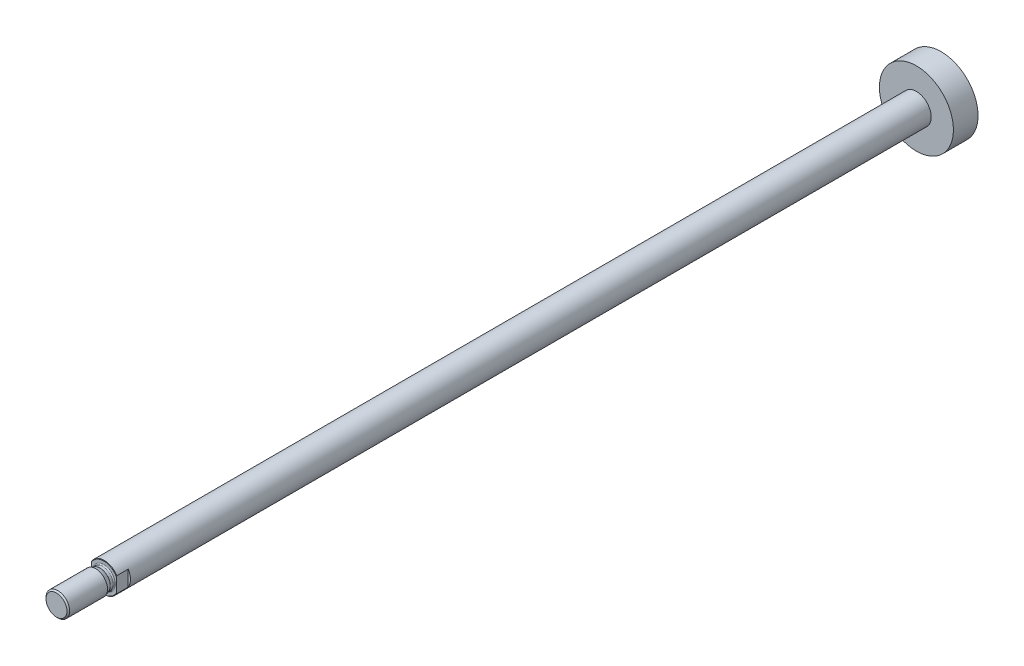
ISO-10303-21;
HEADER;
FILE_DESCRIPTION(('STEP AP214'),'2;1');
FILE_NAME('part.step','',(''),(''),'','','');
FILE_SCHEMA(('AUTOMOTIVE_DESIGN { 1 0 10303 214 1 1 1 1 }'));
ENDSEC;
DATA;
#1=APPLICATION_CONTEXT('core data for automotive mechanical design processes');
#2=APPLICATION_PROTOCOL_DEFINITION('international standard','automotive_design',2000,#1);
#3=PRODUCT_CONTEXT('',#1,'mechanical');
#4=PRODUCT('Part','Part','',(#3));
#5=PRODUCT_RELATED_PRODUCT_CATEGORY('part','',(#4));
#6=PRODUCT_DEFINITION_FORMATION('','',#4);
#7=PRODUCT_DEFINITION_CONTEXT('part definition',#1,'design');
#8=PRODUCT_DEFINITION('design','',#6,#7);
#9=PRODUCT_DEFINITION_SHAPE('','',#8);
#10=(LENGTH_UNIT() NAMED_UNIT(*) SI_UNIT(.MILLI.,.METRE.));
#11=(NAMED_UNIT(*) PLANE_ANGLE_UNIT() SI_UNIT($,.RADIAN.));
#12=(NAMED_UNIT(*) SI_UNIT($,.STERADIAN.) SOLID_ANGLE_UNIT());
#13=UNCERTAINTY_MEASURE_WITH_UNIT(LENGTH_MEASURE(1.E-05),#10,'distance_accuracy_value','');
#14=(GEOMETRIC_REPRESENTATION_CONTEXT(3) GLOBAL_UNCERTAINTY_ASSIGNED_CONTEXT((#13)) GLOBAL_UNIT_ASSIGNED_CONTEXT((#10,
#11,#12)) REPRESENTATION_CONTEXT('',''));
#15=CARTESIAN_POINT('',(0.,0.,0.));
#16=DIRECTION('',(0.,0.,1.));
#17=DIRECTION('',(1.,0.,0.));
#18=AXIS2_PLACEMENT_3D('',#15,#16,#17);
#19=CARTESIAN_POINT('',(-25.,0.,-356.333333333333));
#20=DIRECTION('',(0.,0.,1.));
#21=DIRECTION('',(1.,0.,0.));
#22=AXIS2_PLACEMENT_3D('',#19,#20,#21);
#23=PLANE('',#22);
#24=CARTESIAN_POINT('',(0.,0.,-356.333333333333));
#25=DIRECTION('',(0.,0.,1.));
#26=DIRECTION('',(1.,0.,0.));
#27=AXIS2_PLACEMENT_3D('',#24,#25,#26);
#28=CIRCLE('',#27,10.);
#29=CARTESIAN_POINT('',(10.,0.,-356.333333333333));
#30=VERTEX_POINT('',#29);
#31=EDGE_CURVE('E11',#30,#30,#28,.T.);
#32=ORIENTED_EDGE('',*,*,#31,.F.);
#33=EDGE_LOOP('',(#32));
#34=FACE_BOUND('',#33,.T.);
#35=CARTESIAN_POINT('',(0.,0.,-356.333333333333));
#36=DIRECTION('',(0.,0.,-1.));
#37=DIRECTION('',(-1.,0.,0.));
#38=AXIS2_PLACEMENT_3D('',#35,#36,#37);
#39=CIRCLE('',#38,25.);
#40=CARTESIAN_POINT('',(-25.,0.,-356.333333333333));
#41=VERTEX_POINT('',#40);
#42=EDGE_CURVE('E154',#41,#41,#39,.T.);
#43=ORIENTED_EDGE('',*,*,#42,.F.);
#44=EDGE_LOOP('',(#43));
#45=FACE_BOUND('',#44,.T.);
#46=ADVANCED_FACE('F41',(#34,#45),#23,.T.);
#47=CARTESIAN_POINT('',(0.,25.,-373.));
#48=DIRECTION('',(0.,0.,1.));
#49=DIRECTION('',(1.,0.,0.));
#50=AXIS2_PLACEMENT_3D('',#47,#48,#49);
#51=PLANE('',#50);
#52=CARTESIAN_POINT('',(0.,0.,-373.));
#53=DIRECTION('',(0.,0.,-1.));
#54=DIRECTION('',(-1.,0.,0.));
#55=AXIS2_PLACEMENT_3D('',#52,#53,#54);
#56=CIRCLE('',#55,25.);
#57=CARTESIAN_POINT('',(-25.,0.,-373.));
#58=VERTEX_POINT('',#57);
#59=EDGE_CURVE('E44',#58,#58,#56,.T.);
#60=ORIENTED_EDGE('',*,*,#59,.T.);
#61=EDGE_LOOP('',(#60));
#62=FACE_BOUND('',#61,.T.);
#63=ADVANCED_FACE('F233',(#62),#51,.F.);
#64=CARTESIAN_POINT('',(0.,0.,-373.));
#65=DIRECTION('',(0.,0.,-1.));
#66=DIRECTION('',(-1.,0.,0.));
#67=AXIS2_PLACEMENT_3D('',#64,#65,#66);
#68=CYLINDRICAL_SURFACE('',#67,25.);
#69=ORIENTED_EDGE('',*,*,#59,.F.);
#70=EDGE_LOOP('',(#69));
#71=FACE_BOUND('',#70,.T.);
#72=ORIENTED_EDGE('',*,*,#42,.T.);
#73=EDGE_LOOP('',(#72));
#74=FACE_BOUND('',#73,.T.);
#75=ADVANCED_FACE('F235',(#71,#74),#68,.T.);
#76=CARTESIAN_POINT('',(0.,0.,-373.002));
#77=DIRECTION('',(0.,0.,1.));
#78=DIRECTION('',(1.,0.,0.));
#79=AXIS2_PLACEMENT_3D('',#76,#77,#78);
#80=CYLINDRICAL_SURFACE('',#79,10.);
#81=ORIENTED_EDGE('',*,*,#31,.T.);
#82=EDGE_LOOP('',(#81));
#83=FACE_BOUND('',#82,.T.);
#84=DIRECTION('',(0.,0.,-1.));
#85=VECTOR('',#84,1.);
#86=CARTESIAN_POINT('',(8.5,-5.26782687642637,-216.));
#87=LINE('',#86,#85);
#88=CARTESIAN_POINT('',(8.5,-5.26782687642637,192.517157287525));
#89=VERTEX_POINT('',#88);
#90=CARTESIAN_POINT('',(8.5,-5.26782687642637,184.8));
#91=VERTEX_POINT('',#90);
#92=EDGE_CURVE('E142',#89,#91,#87,.T.);
#93=ORIENTED_EDGE('',*,*,#92,.F.);
#94=CARTESIAN_POINT('',(0.,0.,192.517157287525));
#95=DIRECTION('',(0.,0.,-1.));
#96=DIRECTION('',(-1.,0.,0.));
#97=AXIS2_PLACEMENT_3D('',#94,#95,#96);
#98=CIRCLE('',#97,10.);
#99=CARTESIAN_POINT('',(-8.5,-5.26782687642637,192.517157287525));
#100=VERTEX_POINT('',#99);
#101=EDGE_CURVE('E174',#89,#100,#98,.T.);
#102=ORIENTED_EDGE('',*,*,#101,.T.);
#103=DIRECTION('',(0.,0.,1.));
#104=VECTOR('',#103,1.);
#105=CARTESIAN_POINT('',(-8.5,-5.26782687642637,-216.));
#106=LINE('',#105,#104);
#107=CARTESIAN_POINT('',(-8.5,-5.26782687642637,184.8));
#108=VERTEX_POINT('',#107);
#109=EDGE_CURVE('E93',#108,#100,#106,.T.);
#110=ORIENTED_EDGE('',*,*,#109,.F.);
#111=CARTESIAN_POINT('',(0.,0.,184.8));
#112=DIRECTION('',(0.,0.,1.));
#113=DIRECTION('',(1.,0.,0.));
#114=AXIS2_PLACEMENT_3D('',#111,#112,#113);
#115=CIRCLE('',#114,10.);
#116=CARTESIAN_POINT('',(-8.5,5.26782687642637,184.8));
#117=VERTEX_POINT('',#116);
#118=EDGE_CURVE('E175',#117,#108,#115,.T.);
#119=ORIENTED_EDGE('',*,*,#118,.F.);
#120=DIRECTION('',(0.,0.,-1.));
#121=VECTOR('',#120,1.);
#122=CARTESIAN_POINT('',(-8.5,5.26782687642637,-216.));
#123=LINE('',#122,#121);
#124=CARTESIAN_POINT('',(-8.5,5.26782687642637,192.517157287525));
#125=VERTEX_POINT('',#124);
#126=EDGE_CURVE('E102',#125,#117,#123,.T.);
#127=ORIENTED_EDGE('',*,*,#126,.F.);
#128=CARTESIAN_POINT('',(0.,0.,192.517157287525));
#129=DIRECTION('',(0.,0.,-1.));
#130=DIRECTION('',(-1.,0.,0.));
#131=AXIS2_PLACEMENT_3D('',#128,#129,#130);
#132=CIRCLE('',#131,10.);
#133=CARTESIAN_POINT('',(8.5,5.26782687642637,192.517157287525));
#134=VERTEX_POINT('',#133);
#135=EDGE_CURVE('E172',#125,#134,#132,.T.);
#136=ORIENTED_EDGE('',*,*,#135,.T.);
#137=DIRECTION('',(0.,0.,1.));
#138=VECTOR('',#137,1.);
#139=CARTESIAN_POINT('',(8.5,5.26782687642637,-216.));
#140=LINE('',#139,#138);
#141=CARTESIAN_POINT('',(8.5,5.26782687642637,184.8));
#142=VERTEX_POINT('',#141);
#143=EDGE_CURVE('E139',#142,#134,#140,.T.);
#144=ORIENTED_EDGE('',*,*,#143,.F.);
#145=CARTESIAN_POINT('',(0.,0.,184.8));
#146=DIRECTION('',(0.,0.,1.));
#147=DIRECTION('',(1.,0.,0.));
#148=AXIS2_PLACEMENT_3D('',#145,#146,#147);
#149=CIRCLE('',#148,10.);
#150=EDGE_CURVE('E148',#91,#142,#149,.T.);
#151=ORIENTED_EDGE('',*,*,#150,.F.);
#152=EDGE_LOOP('',(#93,#102,#110,#119,#127,#136,#144,#151));
#153=FACE_BOUND('',#152,.T.);
#154=ADVANCED_FACE('F217',(#83,#153),#80,.T.);
#155=CARTESIAN_POINT('',(0.,0.,192.8));
#156=DIRECTION('',(0.,0.,-1.));
#157=DIRECTION('',(0.,-1.,0.));
#158=AXIS2_PLACEMENT_3D('',#155,#156,#157);
#159=PLANE('',#158);
#160=CARTESIAN_POINT('',(0.,0.,192.8));
#161=DIRECTION('',(0.,0.,-1.));
#162=DIRECTION('',(-1.,0.,0.));
#163=AXIS2_PLACEMENT_3D('',#160,#161,#162);
#164=CIRCLE('',#163,9.71715728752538);
#165=CARTESIAN_POINT('',(-8.5,4.70883698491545,192.8));
#166=VERTEX_POINT('',#165);
#167=CARTESIAN_POINT('',(8.5,4.70883698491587,192.8));
#168=VERTEX_POINT('',#167);
#169=EDGE_CURVE('E164',#166,#168,#164,.T.);
#170=ORIENTED_EDGE('',*,*,#169,.F.);
#171=DIRECTION('',(0.,1.,0.));
#172=VECTOR('',#171,1.);
#173=CARTESIAN_POINT('',(-8.5,0.,192.8));
#174=LINE('',#173,#172);
#175=CARTESIAN_POINT('',(-8.5,-4.70883698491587,192.8));
#176=VERTEX_POINT('',#175);
#177=EDGE_CURVE('E61',#176,#166,#174,.T.);
#178=ORIENTED_EDGE('',*,*,#177,.F.);
#179=CARTESIAN_POINT('',(0.,0.,192.8));
#180=DIRECTION('',(0.,0.,-1.));
#181=DIRECTION('',(-1.,0.,0.));
#182=AXIS2_PLACEMENT_3D('',#179,#180,#181);
#183=CIRCLE('',#182,9.71715728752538);
#184=CARTESIAN_POINT('',(8.5,-4.70883698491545,192.8));
#185=VERTEX_POINT('',#184);
#186=EDGE_CURVE('E160',#185,#176,#183,.T.);
#187=ORIENTED_EDGE('',*,*,#186,.F.);
#188=DIRECTION('',(0.,-1.,0.));
#189=VECTOR('',#188,1.);
#190=CARTESIAN_POINT('',(8.5,0.,192.8));
#191=LINE('',#190,#189);
#192=EDGE_CURVE('E179',#168,#185,#191,.T.);
#193=ORIENTED_EDGE('',*,*,#192,.F.);
#194=EDGE_LOOP('',(#170,#178,#187,#193));
#195=FACE_BOUND('',#194,.T.);
#196=CARTESIAN_POINT('',(0.,0.,192.8));
#197=DIRECTION('',(0.,0.,-1.));
#198=DIRECTION('',(-1.,0.,0.));
#199=AXIS2_PLACEMENT_3D('',#196,#197,#198);
#200=CIRCLE('',#199,7.7);
#201=CARTESIAN_POINT('',(-7.7,0.,192.8));
#202=VERTEX_POINT('',#201);
#203=EDGE_CURVE('E156',#202,#202,#200,.T.);
#204=ORIENTED_EDGE('',*,*,#203,.T.);
#205=EDGE_LOOP('',(#204));
#206=FACE_BOUND('',#205,.T.);
#207=ADVANCED_FACE('F246',(#195,#206),#159,.F.);
#208=CARTESIAN_POINT('',(0.,0.,192.8));
#209=DIRECTION('',(0.,0.,-1.));
#210=DIRECTION('',(-1.,0.,0.));
#211=AXIS2_PLACEMENT_3D('',#208,#209,#210);
#212=CONICAL_SURFACE('',#211,9.71715728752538,0.785398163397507);
#213=CARTESIAN_POINT('',(8.5,-4.70883698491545,192.8));
#214=CARTESIAN_POINT('',(8.5,-4.89640601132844,192.709105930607));
#215=CARTESIAN_POINT('',(8.5,-5.08268534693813,192.614686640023));
#216=CARTESIAN_POINT('',(8.5,-5.26782687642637,192.517157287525));
#217=(BOUNDED_CURVE() B_SPLINE_CURVE(3,(#213,#214,#215,#216),.UNSPECIFIED.,.F.,
.F.) B_SPLINE_CURVE_WITH_KNOTS((4,4),(0.0103936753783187,0.011015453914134),
.UNSPECIFIED.) CURVE() GEOMETRIC_REPRESENTATION_ITEM() RATIONAL_B_SPLINE_CURVE((1.,1.,1.,1.)) REPRESENTATION_ITEM(''));
#218=EDGE_CURVE('E168',#185,#89,#217,.T.);
#219=ORIENTED_EDGE('',*,*,#218,.F.);
#220=ORIENTED_EDGE('',*,*,#186,.T.);
#221=CARTESIAN_POINT('',(-8.5,-5.26782687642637,192.517157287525));
#222=CARTESIAN_POINT('',(-8.5,-5.08267754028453,192.614690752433));
#223=CARTESIAN_POINT('',(-8.5,-4.89639776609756,192.709109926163));
#224=CARTESIAN_POINT('',(-8.5,-4.7088369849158,192.8));
#225=(BOUNDED_CURVE() B_SPLINE_CURVE(3,(#221,#222,#223,#224),.UNSPECIFIED.,.F.,
.F.) B_SPLINE_CURVE_WITH_KNOTS((4,4),(1.48780611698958E-06,0.000623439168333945),
.UNSPECIFIED.) CURVE() GEOMETRIC_REPRESENTATION_ITEM() RATIONAL_B_SPLINE_CURVE((1.,1.,1.,1.)) REPRESENTATION_ITEM(''));
#226=EDGE_CURVE('E189',#100,#176,#225,.T.);
#227=ORIENTED_EDGE('',*,*,#226,.F.);
#228=ORIENTED_EDGE('',*,*,#101,.F.);
#229=EDGE_LOOP('',(#219,#220,#227,#228));
#230=FACE_BOUND('',#229,.T.);
#231=ADVANCED_FACE('F230',(#230),#212,.T.);
#232=CARTESIAN_POINT('',(0.,0.,192.8));
#233=DIRECTION('',(0.,0.,-1.));
#234=DIRECTION('',(-1.,0.,0.));
#235=AXIS2_PLACEMENT_3D('',#232,#233,#234);
#236=CONICAL_SURFACE('',#235,9.71715728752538,0.785398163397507);
#237=CARTESIAN_POINT('',(-8.5,4.70883698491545,192.8));
#238=CARTESIAN_POINT('',(-8.5,4.89640601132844,192.709105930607));
#239=CARTESIAN_POINT('',(-8.5,5.08268534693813,192.614686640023));
#240=CARTESIAN_POINT('',(-8.5,5.26782687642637,192.517157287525));
#241=(BOUNDED_CURVE() B_SPLINE_CURVE(3,(#237,#238,#239,#240),.UNSPECIFIED.,.F.,
.F.) B_SPLINE_CURVE_WITH_KNOTS((4,4),(0.0103936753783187,0.011015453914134),
.UNSPECIFIED.) CURVE() GEOMETRIC_REPRESENTATION_ITEM() RATIONAL_B_SPLINE_CURVE((1.,1.,1.,1.)) REPRESENTATION_ITEM(''));
#242=EDGE_CURVE('E144',#166,#125,#241,.T.);
#243=ORIENTED_EDGE('',*,*,#242,.F.);
#244=ORIENTED_EDGE('',*,*,#169,.T.);
#245=CARTESIAN_POINT('',(8.5,5.26782687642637,192.517157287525));
#246=CARTESIAN_POINT('',(8.5,5.08267754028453,192.614690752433));
#247=CARTESIAN_POINT('',(8.5,4.89639776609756,192.709109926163));
#248=CARTESIAN_POINT('',(8.5,4.7088369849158,192.8));
#249=(BOUNDED_CURVE() B_SPLINE_CURVE(3,(#245,#246,#247,#248),.UNSPECIFIED.,.F.,
.F.) B_SPLINE_CURVE_WITH_KNOTS((4,4),(1.48780611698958E-06,0.000623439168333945),
.UNSPECIFIED.) CURVE() GEOMETRIC_REPRESENTATION_ITEM() RATIONAL_B_SPLINE_CURVE((1.,1.,1.,1.)) REPRESENTATION_ITEM(''));
#250=EDGE_CURVE('E143',#134,#168,#249,.T.);
#251=ORIENTED_EDGE('',*,*,#250,.F.);
#252=ORIENTED_EDGE('',*,*,#135,.F.);
#253=EDGE_LOOP('',(#243,#244,#251,#252));
#254=FACE_BOUND('',#253,.T.);
#255=ADVANCED_FACE('F215',(#254),#236,.T.);
#256=CARTESIAN_POINT('',(-8.5,17.,184.8));
#257=DIRECTION('',(0.,0.,1.));
#258=DIRECTION('',(1.,0.,0.));
#259=AXIS2_PLACEMENT_3D('',#256,#257,#258);
#260=PLANE('',#259);
#261=ORIENTED_EDGE('',*,*,#118,.T.);
#262=DIRECTION('',(0.,-1.,0.));
#263=VECTOR('',#262,1.);
#264=CARTESIAN_POINT('',(-8.5,17.,184.8));
#265=LINE('',#264,#263);
#266=EDGE_CURVE('E182',#117,#108,#265,.T.);
#267=ORIENTED_EDGE('',*,*,#266,.F.);
#268=EDGE_LOOP('',(#261,#267));
#269=FACE_BOUND('',#268,.T.);
#270=ADVANCED_FACE('F220',(#269),#260,.T.);
#271=CARTESIAN_POINT('',(-8.5,17.,200.8));
#272=DIRECTION('',(-1.,0.,0.));
#273=DIRECTION('',(0.,0.,1.));
#274=AXIS2_PLACEMENT_3D('',#271,#272,#273);
#275=PLANE('',#274);
#276=ORIENTED_EDGE('',*,*,#126,.T.);
#277=ORIENTED_EDGE('',*,*,#266,.T.);
#278=ORIENTED_EDGE('',*,*,#109,.T.);
#279=ORIENTED_EDGE('',*,*,#226,.T.);
#280=ORIENTED_EDGE('',*,*,#177,.T.);
#281=ORIENTED_EDGE('',*,*,#242,.T.);
#282=EDGE_LOOP('',(#276,#277,#278,#279,#280,#281));
#283=FACE_BOUND('',#282,.T.);
#284=ADVANCED_FACE('F222',(#283),#275,.T.);
#285=CARTESIAN_POINT('',(17.,17.,184.8));
#286=DIRECTION('',(0.,0.,1.));
#287=DIRECTION('',(1.,0.,0.));
#288=AXIS2_PLACEMENT_3D('',#285,#286,#287);
#289=PLANE('',#288);
#290=ORIENTED_EDGE('',*,*,#150,.T.);
#291=DIRECTION('',(0.,-1.,0.));
#292=VECTOR('',#291,1.);
#293=CARTESIAN_POINT('',(8.5,17.,184.8));
#294=LINE('',#293,#292);
#295=EDGE_CURVE('E137',#142,#91,#294,.T.);
#296=ORIENTED_EDGE('',*,*,#295,.T.);
#297=EDGE_LOOP('',(#290,#296));
#298=FACE_BOUND('',#297,.T.);
#299=ADVANCED_FACE('F228',(#298),#289,.T.);
#300=CARTESIAN_POINT('',(8.5,17.,184.8));
#301=DIRECTION('',(1.,0.,0.));
#302=DIRECTION('',(0.,1.,0.));
#303=AXIS2_PLACEMENT_3D('',#300,#301,#302);
#304=PLANE('',#303);
#305=ORIENTED_EDGE('',*,*,#92,.T.);
#306=ORIENTED_EDGE('',*,*,#295,.F.);
#307=ORIENTED_EDGE('',*,*,#143,.T.);
#308=ORIENTED_EDGE('',*,*,#250,.T.);
#309=ORIENTED_EDGE('',*,*,#192,.T.);
#310=ORIENTED_EDGE('',*,*,#218,.T.);
#311=EDGE_LOOP('',(#305,#306,#307,#308,#309,#310));
#312=FACE_BOUND('',#311,.T.);
#313=ADVANCED_FACE('F209',(#312),#304,.T.);
#314=CARTESIAN_POINT('',(0.,0.,224.8));
#315=DIRECTION('',(0.,0.,-1.));
#316=DIRECTION('',(0.,-1.,0.));
#317=AXIS2_PLACEMENT_3D('',#314,#315,#316);
#318=PLANE('',#317);
#319=CARTESIAN_POINT('',(0.,0.,224.8));
#320=DIRECTION('',(0.,0.,-1.));
#321=DIRECTION('',(-1.,0.,0.));
#322=AXIS2_PLACEMENT_3D('',#319,#320,#321);
#323=CIRCLE('',#322,7.08);
#324=CARTESIAN_POINT('',(-7.08,0.,224.8));
#325=VERTEX_POINT('',#324);
#326=EDGE_CURVE('E130',#325,#325,#323,.T.);
#327=ORIENTED_EDGE('',*,*,#326,.F.);
#328=EDGE_LOOP('',(#327));
#329=FACE_BOUND('',#328,.T.);
#330=ADVANCED_FACE('F251',(#329),#318,.F.);
#331=CARTESIAN_POINT('',(0.,0.,224.8));
#332=DIRECTION('',(0.,0.,-1.));
#333=DIRECTION('',(-1.,0.,0.));
#334=AXIS2_PLACEMENT_3D('',#331,#332,#333);
#335=CONICAL_SURFACE('',#334,7.08,0.785398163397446);
#336=CARTESIAN_POINT('',(0.,0.,223.88));
#337=DIRECTION('',(0.,0.,-1.));
#338=DIRECTION('',(-1.,0.,0.));
#339=AXIS2_PLACEMENT_3D('',#336,#337,#338);
#340=CIRCLE('',#339,8.);
#341=CARTESIAN_POINT('',(-8.,0.,223.88));
#342=VERTEX_POINT('',#341);
#343=EDGE_CURVE('E126',#342,#342,#340,.T.);
#344=ORIENTED_EDGE('',*,*,#343,.F.);
#345=EDGE_LOOP('',(#344));
#346=FACE_BOUND('',#345,.T.);
#347=ORIENTED_EDGE('',*,*,#326,.T.);
#348=EDGE_LOOP('',(#347));
#349=FACE_BOUND('',#348,.T.);
#350=ADVANCED_FACE('F249',(#346,#349),#335,.T.);
#351=CARTESIAN_POINT('',(0.,0.,192.05));
#352=DIRECTION('',(0.,0.,-1.));
#353=DIRECTION('',(-1.,0.,0.));
#354=AXIS2_PLACEMENT_3D('',#351,#352,#353);
#355=CYLINDRICAL_SURFACE('',#354,8.);
#356=CARTESIAN_POINT('',(0.,0.,198.284851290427));
#357=DIRECTION('',(0.,0.,-1.));
#358=DIRECTION('',(-1.,0.,0.));
#359=AXIS2_PLACEMENT_3D('',#356,#357,#358);
#360=CIRCLE('',#359,8.);
#361=CARTESIAN_POINT('',(-8.,0.,198.284851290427));
#362=VERTEX_POINT('',#361);
#363=EDGE_CURVE('E122',#362,#362,#360,.T.);
#364=ORIENTED_EDGE('',*,*,#363,.F.);
#365=EDGE_LOOP('',(#364));
#366=FACE_BOUND('',#365,.T.);
#367=ORIENTED_EDGE('',*,*,#343,.T.);
#368=EDGE_LOOP('',(#367));
#369=FACE_BOUND('',#368,.T.);
#370=ADVANCED_FACE('F123',(#366,#369),#355,.T.);
#371=CARTESIAN_POINT('',(0.,0.,198.284851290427));
#372=DIRECTION('',(0.,0.,1.));
#373=DIRECTION('',(1.,0.,0.));
#374=AXIS2_PLACEMENT_3D('',#371,#372,#373);
#375=CONICAL_SURFACE('',#374,8.,0.349065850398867);
#376=CARTESIAN_POINT('',(0.,0.,195.524269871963));
#377=DIRECTION('',(0.,0.,-1.));
#378=DIRECTION('',(-1.,0.,0.));
#379=AXIS2_PLACEMENT_3D('',#376,#377,#378);
#380=CIRCLE('',#379,6.99523053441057);
#381=CARTESIAN_POINT('',(-6.99523053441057,0.,195.524269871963));
#382=VERTEX_POINT('',#381);
#383=EDGE_CURVE('E127',#382,#382,#380,.T.);
#384=ORIENTED_EDGE('',*,*,#383,.F.);
#385=EDGE_LOOP('',(#384));
#386=FACE_BOUND('',#385,.T.);
#387=ORIENTED_EDGE('',*,*,#363,.T.);
#388=EDGE_LOOP('',(#387));
#389=FACE_BOUND('',#388,.T.);
#390=ADVANCED_FACE('F257',(#386,#389),#375,.T.);
#391=CARTESIAN_POINT('',(0.,0.,195.267754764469));
#392=DIRECTION('',(0.,0.,-1.));
#393=DIRECTION('',(-1.,0.,0.));
#394=AXIS2_PLACEMENT_3D('',#391,#392,#393);
#395=TOROIDAL_SURFACE('',#394,7.7,0.749999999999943);
#396=CARTESIAN_POINT('',(0.,0.,195.267754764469));
#397=DIRECTION('',(0.,0.,-1.));
#398=DIRECTION('',(-1.,0.,0.));
#399=AXIS2_PLACEMENT_3D('',#396,#397,#398);
#400=CIRCLE('',#399,6.95);
#401=CARTESIAN_POINT('',(-6.95,0.,195.267754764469));
#402=VERTEX_POINT('',#401);
#403=EDGE_CURVE('E133',#402,#402,#400,.T.);
#404=ORIENTED_EDGE('',*,*,#403,.F.);
#405=EDGE_LOOP('',(#404));
#406=FACE_BOUND('',#405,.T.);
#407=ORIENTED_EDGE('',*,*,#383,.T.);
#408=EDGE_LOOP('',(#407));
#409=FACE_BOUND('',#408,.T.);
#410=ADVANCED_FACE('F260',(#406,#409),#395,.F.);
#411=CARTESIAN_POINT('',(0.,0.,192.05));
#412=DIRECTION('',(0.,0.,-1.));
#413=DIRECTION('',(-1.,0.,0.));
#414=AXIS2_PLACEMENT_3D('',#411,#412,#413);
#415=CYLINDRICAL_SURFACE('',#414,6.95);
#416=CARTESIAN_POINT('',(0.,0.,193.55));
#417=DIRECTION('',(0.,0.,-1.));
#418=DIRECTION('',(-1.,0.,0.));
#419=AXIS2_PLACEMENT_3D('',#416,#417,#418);
#420=CIRCLE('',#419,6.95);
#421=CARTESIAN_POINT('',(-6.95,0.,193.55));
#422=VERTEX_POINT('',#421);
#423=EDGE_CURVE('E149',#422,#422,#420,.T.);
#424=ORIENTED_EDGE('',*,*,#423,.F.);
#425=EDGE_LOOP('',(#424));
#426=FACE_BOUND('',#425,.T.);
#427=ORIENTED_EDGE('',*,*,#403,.T.);
#428=EDGE_LOOP('',(#427));
#429=FACE_BOUND('',#428,.T.);
#430=ADVANCED_FACE('F270',(#426,#429),#415,.T.);
#431=CARTESIAN_POINT('',(0.,0.,193.55));
#432=DIRECTION('',(0.,0.,-1.));
#433=DIRECTION('',(-1.,0.,0.));
#434=AXIS2_PLACEMENT_3D('',#431,#432,#433);
#435=TOROIDAL_SURFACE('',#434,7.7,0.75);
#436=ORIENTED_EDGE('',*,*,#203,.F.);
#437=EDGE_LOOP('',(#436));
#438=FACE_BOUND('',#437,.T.);
#439=ORIENTED_EDGE('',*,*,#423,.T.);
#440=EDGE_LOOP('',(#439));
#441=FACE_BOUND('',#440,.T.);
#442=ADVANCED_FACE('F248',(#438,#441),#435,.F.);
#443=CLOSED_SHELL('',(#46,#63,#75,#154,#207,#231,#255,#270,#284,#299,#313,#330,#350,#370,#390,
#410,#430,#442));
#444=MANIFOLD_SOLID_BREP('B2',#443);
#445=ADVANCED_BREP_SHAPE_REPRESENTATION('',(#18,#444),#14);
#446=SHAPE_DEFINITION_REPRESENTATION(#9,#445);
ENDSEC;
END-ISO-10303-21;
